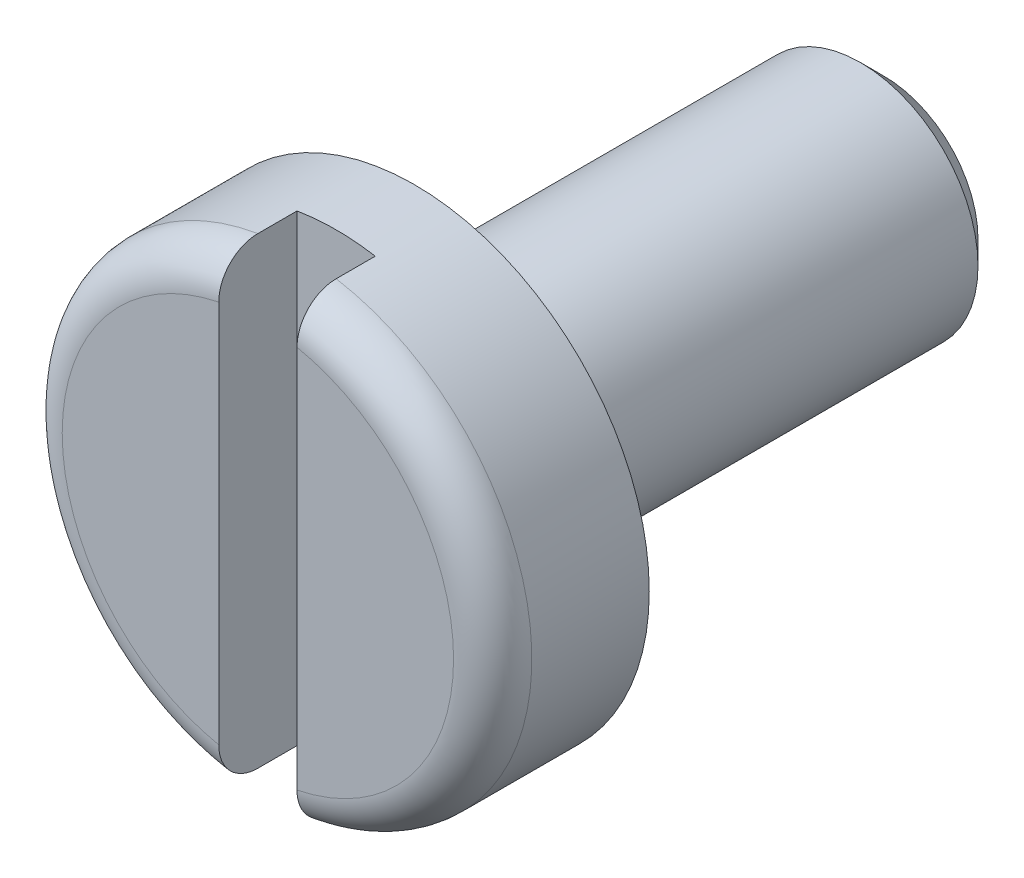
from build123d import *

# Parameters (mm, degrees)
ESQUISSE1_R             = 1.5
EXTRUSION1_DEPTH        = 6
ESQUISSE2_R             = 3
EXTRUSION2_DEPTH        = 2
CONG_1_R                = 0.5
CHANFREIN1_SIZE         = 0.3
ESQUISSE3_W             = 1
ESQUISSE3_H             = 6.610384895
ENL_V_MAT_EXTRU_1_DEPTH = 1


with BuildPart() as part:
    # Esquisse1 → Extrusion1 (new body)
    with BuildSketch(Plane.XY):
        Circle(ESQUISSE1_R)
    extrude(amount=EXTRUSION1_DEPTH)

    # Esquisse2 → Extrusion2 (add)
    with BuildSketch(Plane.XY.offset(6)):
        Circle(ESQUISSE2_R)
    extrude(amount=EXTRUSION2_DEPTH)

    # Cong_1
    cong_1_edges = [part.edges().sort_by_distance(p)[0] for p in [
        (-3, 0, 8),
    ]]
    fillet(cong_1_edges, radius=CONG_1_R)

    # Chanfrein1
    chanfrein1_edges = [part.edges().sort_by_distance(p)[0] for p in [
        (-1.5, 0, 0),
    ]]
    chamfer(chanfrein1_edges, length=CHANFREIN1_SIZE)

    # Esquisse3 → Enl_v. mat.-Extru.1 (cut)
    with BuildSketch(Plane.XY.offset(8)):
        with Locations((0, -0.076555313)):
            Rectangle(ESQUISSE3_W, ESQUISSE3_H)
    extrude(amount=-ENL_V_MAT_EXTRU_1_DEPTH, mode=Mode.SUBTRACT)


solid = part.part
